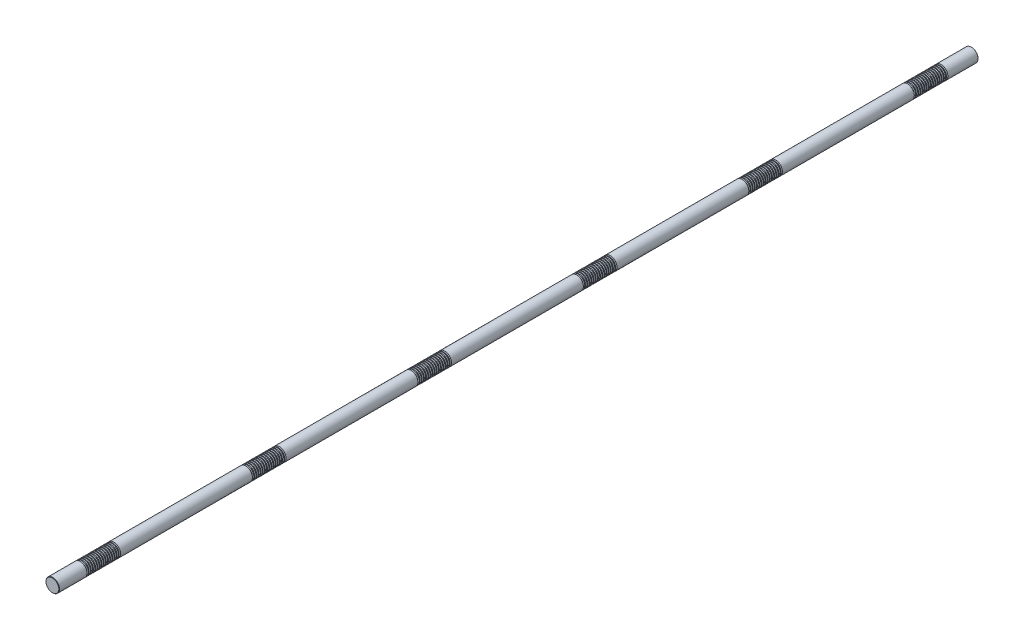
from build123d import *

# Parameters (mm, degrees)
SKETCH1_R           = 22
BOSS_EXTRUDE1_DEPTH = 1500
CHAMFER1_SIZE       = 1.1
LPATTERN1_COUNT     = 16
LPATTERN1_PITCH     = 7
LPATTERN2_COUNT     = 6
LPATTERN2_PITCH     = 540


with BuildPart() as part:
    # Sketch1 → Boss-Extrude1 (new, symmetric)
    with BuildSketch(Plane.XY):
        Circle(SKETCH1_R)
    extrude(amount=BOSS_EXTRUDE1_DEPTH, both=True)

    # Chamfer1
    chamfer1_edges = [part.edges().sort_by_distance(p)[0] for p in [
        (-22, 0, -1500),
        (-22, 0, 1500),
    ]]
    chamfer(chamfer1_edges, length=CHAMFER1_SIZE)

    # Sketch2 → Cut-Revolve1 (revolve, cut)
    with BuildSketch(Plane(origin=(0, 0, 0), x_dir=(0, 0, -1), z_dir=(1, 0, 0)), mode=Mode.PRIVATE) as cut_revolve1_sk:
        Polygon((1400.535898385, 22), (1395.964101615, 22), (1397.035898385, 18), (1399.464101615, 18), align=None)
    cut_revolve1 = revolve(cut_revolve1_sk.sketch.rotate(Axis((0, 0, 1500), (0, 0, -1)), 90), axis=Axis((0, 0, 1500), (0, 0, -1)), mode=Mode.SUBTRACT)

    # LPattern1: Cut-Revolve1 ×16
    with Locations(*[(0, 0, i * LPATTERN1_PITCH) for i in range(1, LPATTERN1_COUNT)]):
        add(cut_revolve1, mode=Mode.SUBTRACT)

    # LPattern2: Cut-Revolve1 ×6
    with Locations(*[(0, 0, i * LPATTERN2_PITCH) for i in range(1, LPATTERN2_COUNT)]):
        add(cut_revolve1, mode=Mode.SUBTRACT)

    # LPattern2 copy 1 sketch → LPattern2 copy 1 (revolve, cut)
    with BuildSketch(Plane(origin=(0, 0, 547), x_dir=(0, 0, -1), z_dir=(1, 0, 0))):
        Polygon((1400.535898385, 22), (1395.964101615, 22), (1397.035898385, 18), (1399.464101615, 18), align=None)
    revolve(axis=Axis((0, 0, 2047), (0, 0, -1)), mode=Mode.SUBTRACT)

    # LPattern2 copy 2 sketch → LPattern2 copy 2 (revolve, cut)
    with BuildSketch(Plane(origin=(0, 0, 1087), x_dir=(0, 0, -1), z_dir=(1, 0, 0))):
        Polygon((1400.535898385, 22), (1395.964101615, 22), (1397.035898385, 18), (1399.464101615, 18), align=None)
    revolve(axis=Axis((0, 0, 2587), (0, 0, -1)), mode=Mode.SUBTRACT)

    # LPattern2 copy 3 sketch → LPattern2 copy 3 (revolve, cut)
    with BuildSketch(Plane(origin=(0, 0, 1627), x_dir=(0, 0, -1), z_dir=(1, 0, 0))):
        Polygon((1400.535898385, 22), (1395.964101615, 22), (1397.035898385, 18), (1399.464101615, 18), align=None)
    revolve(axis=Axis((0, 0, 3127), (0, 0, -1)), mode=Mode.SUBTRACT)

    # LPattern2 copy 4 sketch → LPattern2 copy 4 (revolve, cut)
    with BuildSketch(Plane(origin=(0, 0, 2167), x_dir=(0, 0, -1), z_dir=(1, 0, 0))):
        Polygon((1400.535898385, 22), (1395.964101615, 22), (1397.035898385, 18), (1399.464101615, 18), align=None)
    revolve(axis=Axis((0, 0, 3667), (0, 0, -1)), mode=Mode.SUBTRACT)

    # LPattern2 copy 5 sketch → LPattern2 copy 5 (revolve, cut)
    with BuildSketch(Plane(origin=(0, 0, 2707), x_dir=(0, 0, -1), z_dir=(1, 0, 0))):
        Polygon((1400.535898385, 22), (1395.964101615, 22), (1397.035898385, 18), (1399.464101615, 18), align=None)
    revolve(axis=Axis((0, 0, 4207), (0, 0, -1)), mode=Mode.SUBTRACT)

    # LPattern2 copy 6 sketch → LPattern2 copy 6 (revolve, cut)
    with BuildSketch(Plane(origin=(0, 0, 554), x_dir=(0, 0, -1), z_dir=(1, 0, 0))):
        Polygon((1400.535898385, 22), (1395.964101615, 22), (1397.035898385, 18), (1399.464101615, 18), align=None)
    revolve(axis=Axis((0, 0, 2054), (0, 0, -1)), mode=Mode.SUBTRACT)

    # LPattern2 copy 7 sketch → LPattern2 copy 7 (revolve, cut)
    with BuildSketch(Plane(origin=(0, 0, 1094), x_dir=(0, 0, -1), z_dir=(1, 0, 0))):
        Polygon((1400.535898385, 22), (1395.964101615, 22), (1397.035898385, 18), (1399.464101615, 18), align=None)
    revolve(axis=Axis((0, 0, 2594), (0, 0, -1)), mode=Mode.SUBTRACT)

    # LPattern2 copy 8 sketch → LPattern2 copy 8 (revolve, cut)
    with BuildSketch(Plane(origin=(0, 0, 1634), x_dir=(0, 0, -1), z_dir=(1, 0, 0))):
        Polygon((1400.535898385, 22), (1395.964101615, 22), (1397.035898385, 18), (1399.464101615, 18), align=None)
    revolve(axis=Axis((0, 0, 3134), (0, 0, -1)), mode=Mode.SUBTRACT)

    # LPattern2 copy 9 sketch → LPattern2 copy 9 (revolve, cut)
    with BuildSketch(Plane(origin=(0, 0, 2174), x_dir=(0, 0, -1), z_dir=(1, 0, 0))):
        Polygon((1400.535898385, 22), (1395.964101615, 22), (1397.035898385, 18), (1399.464101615, 18), align=None)
    revolve(axis=Axis((0, 0, 3674), (0, 0, -1)), mode=Mode.SUBTRACT)

    # LPattern2 copy 10 sketch → LPattern2 copy 10 (revolve, cut)
    with BuildSketch(Plane(origin=(0, 0, 2714), x_dir=(0, 0, -1), z_dir=(1, 0, 0))):
        Polygon((1400.535898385, 22), (1395.964101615, 22), (1397.035898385, 18), (1399.464101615, 18), align=None)
    revolve(axis=Axis((0, 0, 4214), (0, 0, -1)), mode=Mode.SUBTRACT)

    # LPattern2 copy 11 sketch → LPattern2 copy 11 (revolve, cut)
    with BuildSketch(Plane(origin=(0, 0, 561), x_dir=(0, 0, -1), z_dir=(1, 0, 0))):
        Polygon((1400.535898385, 22), (1395.964101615, 22), (1397.035898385, 18), (1399.464101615, 18), align=None)
    revolve(axis=Axis((0, 0, 2061), (0, 0, -1)), mode=Mode.SUBTRACT)

    # LPattern2 copy 12 sketch → LPattern2 copy 12 (revolve, cut)
    with BuildSketch(Plane(origin=(0, 0, 1101), x_dir=(0, 0, -1), z_dir=(1, 0, 0))):
        Polygon((1400.535898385, 22), (1395.964101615, 22), (1397.035898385, 18), (1399.464101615, 18), align=None)
    revolve(axis=Axis((0, 0, 2601), (0, 0, -1)), mode=Mode.SUBTRACT)

    # LPattern2 copy 13 sketch → LPattern2 copy 13 (revolve, cut)
    with BuildSketch(Plane(origin=(0, 0, 1641), x_dir=(0, 0, -1), z_dir=(1, 0, 0))):
        Polygon((1400.535898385, 22), (1395.964101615, 22), (1397.035898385, 18), (1399.464101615, 18), align=None)
    revolve(axis=Axis((0, 0, 3141), (0, 0, -1)), mode=Mode.SUBTRACT)

    # LPattern2 copy 14 sketch → LPattern2 copy 14 (revolve, cut)
    with BuildSketch(Plane(origin=(0, 0, 2181), x_dir=(0, 0, -1), z_dir=(1, 0, 0))):
        Polygon((1400.535898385, 22), (1395.964101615, 22), (1397.035898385, 18), (1399.464101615, 18), align=None)
    revolve(axis=Axis((0, 0, 3681), (0, 0, -1)), mode=Mode.SUBTRACT)

    # LPattern2 copy 15 sketch → LPattern2 copy 15 (revolve, cut)
    with BuildSketch(Plane(origin=(0, 0, 2721), x_dir=(0, 0, -1), z_dir=(1, 0, 0))):
        Polygon((1400.535898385, 22), (1395.964101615, 22), (1397.035898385, 18), (1399.464101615, 18), align=None)
    revolve(axis=Axis((0, 0, 4221), (0, 0, -1)), mode=Mode.SUBTRACT)

    # LPattern2 copy 16 sketch → LPattern2 copy 16 (revolve, cut)
    with BuildSketch(Plane(origin=(0, 0, 568), x_dir=(0, 0, -1), z_dir=(1, 0, 0))):
        Polygon((1400.535898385, 22), (1395.964101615, 22), (1397.035898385, 18), (1399.464101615, 18), align=None)
    revolve(axis=Axis((0, 0, 2068), (0, 0, -1)), mode=Mode.SUBTRACT)

    # LPattern2 copy 17 sketch → LPattern2 copy 17 (revolve, cut)
    with BuildSketch(Plane(origin=(0, 0, 1108), x_dir=(0, 0, -1), z_dir=(1, 0, 0))):
        Polygon((1400.535898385, 22), (1395.964101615, 22), (1397.035898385, 18), (1399.464101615, 18), align=None)
    revolve(axis=Axis((0, 0, 2608), (0, 0, -1)), mode=Mode.SUBTRACT)

    # LPattern2 copy 18 sketch → LPattern2 copy 18 (revolve, cut)
    with BuildSketch(Plane(origin=(0, 0, 1648), x_dir=(0, 0, -1), z_dir=(1, 0, 0))):
        Polygon((1400.535898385, 22), (1395.964101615, 22), (1397.035898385, 18), (1399.464101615, 18), align=None)
    revolve(axis=Axis((0, 0, 3148), (0, 0, -1)), mode=Mode.SUBTRACT)

    # LPattern2 copy 19 sketch → LPattern2 copy 19 (revolve, cut)
    with BuildSketch(Plane(origin=(0, 0, 2188), x_dir=(0, 0, -1), z_dir=(1, 0, 0))):
        Polygon((1400.535898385, 22), (1395.964101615, 22), (1397.035898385, 18), (1399.464101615, 18), align=None)
    revolve(axis=Axis((0, 0, 3688), (0, 0, -1)), mode=Mode.SUBTRACT)

    # LPattern2 copy 20 sketch → LPattern2 copy 20 (revolve, cut)
    with BuildSketch(Plane(origin=(0, 0, 2728), x_dir=(0, 0, -1), z_dir=(1, 0, 0))):
        Polygon((1400.535898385, 22), (1395.964101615, 22), (1397.035898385, 18), (1399.464101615, 18), align=None)
    revolve(axis=Axis((0, 0, 4228), (0, 0, -1)), mode=Mode.SUBTRACT)

    # LPattern2 copy 21 sketch → LPattern2 copy 21 (revolve, cut)
    with BuildSketch(Plane(origin=(0, 0, 575), x_dir=(0, 0, -1), z_dir=(1, 0, 0))):
        Polygon((1400.535898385, 22), (1395.964101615, 22), (1397.035898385, 18), (1399.464101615, 18), align=None)
    revolve(axis=Axis((0, 0, 2075), (0, 0, -1)), mode=Mode.SUBTRACT)

    # LPattern2 copy 22 sketch → LPattern2 copy 22 (revolve, cut)
    with BuildSketch(Plane(origin=(0, 0, 1115), x_dir=(0, 0, -1), z_dir=(1, 0, 0))):
        Polygon((1400.535898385, 22), (1395.964101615, 22), (1397.035898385, 18), (1399.464101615, 18), align=None)
    revolve(axis=Axis((0, 0, 2615), (0, 0, -1)), mode=Mode.SUBTRACT)

    # LPattern2 copy 23 sketch → LPattern2 copy 23 (revolve, cut)
    with BuildSketch(Plane(origin=(0, 0, 1655), x_dir=(0, 0, -1), z_dir=(1, 0, 0))):
        Polygon((1400.535898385, 22), (1395.964101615, 22), (1397.035898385, 18), (1399.464101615, 18), align=None)
    revolve(axis=Axis((0, 0, 3155), (0, 0, -1)), mode=Mode.SUBTRACT)

    # LPattern2 copy 24 sketch → LPattern2 copy 24 (revolve, cut)
    with BuildSketch(Plane(origin=(0, 0, 2195), x_dir=(0, 0, -1), z_dir=(1, 0, 0))):
        Polygon((1400.535898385, 22), (1395.964101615, 22), (1397.035898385, 18), (1399.464101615, 18), align=None)
    revolve(axis=Axis((0, 0, 3695), (0, 0, -1)), mode=Mode.SUBTRACT)

    # LPattern2 copy 25 sketch → LPattern2 copy 25 (revolve, cut)
    with BuildSketch(Plane(origin=(0, 0, 2735), x_dir=(0, 0, -1), z_dir=(1, 0, 0))):
        Polygon((1400.535898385, 22), (1395.964101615, 22), (1397.035898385, 18), (1399.464101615, 18), align=None)
    revolve(axis=Axis((0, 0, 4235), (0, 0, -1)), mode=Mode.SUBTRACT)

    # LPattern2 copy 26 sketch → LPattern2 copy 26 (revolve, cut)
    with BuildSketch(Plane(origin=(0, 0, 582), x_dir=(0, 0, -1), z_dir=(1, 0, 0))):
        Polygon((1400.535898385, 22), (1395.964101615, 22), (1397.035898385, 18), (1399.464101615, 18), align=None)
    revolve(axis=Axis((0, 0, 2082), (0, 0, -1)), mode=Mode.SUBTRACT)

    # LPattern2 copy 27 sketch → LPattern2 copy 27 (revolve, cut)
    with BuildSketch(Plane(origin=(0, 0, 1122), x_dir=(0, 0, -1), z_dir=(1, 0, 0))):
        Polygon((1400.535898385, 22), (1395.964101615, 22), (1397.035898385, 18), (1399.464101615, 18), align=None)
    revolve(axis=Axis((0, 0, 2622), (0, 0, -1)), mode=Mode.SUBTRACT)

    # LPattern2 copy 28 sketch → LPattern2 copy 28 (revolve, cut)
    with BuildSketch(Plane(origin=(0, 0, 1662), x_dir=(0, 0, -1), z_dir=(1, 0, 0))):
        Polygon((1400.535898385, 22), (1395.964101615, 22), (1397.035898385, 18), (1399.464101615, 18), align=None)
    revolve(axis=Axis((0, 0, 3162), (0, 0, -1)), mode=Mode.SUBTRACT)

    # LPattern2 copy 29 sketch → LPattern2 copy 29 (revolve, cut)
    with BuildSketch(Plane(origin=(0, 0, 2202), x_dir=(0, 0, -1), z_dir=(1, 0, 0))):
        Polygon((1400.535898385, 22), (1395.964101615, 22), (1397.035898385, 18), (1399.464101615, 18), align=None)
    revolve(axis=Axis((0, 0, 3702), (0, 0, -1)), mode=Mode.SUBTRACT)

    # LPattern2 copy 30 sketch → LPattern2 copy 30 (revolve, cut)
    with BuildSketch(Plane(origin=(0, 0, 2742), x_dir=(0, 0, -1), z_dir=(1, 0, 0))):
        Polygon((1400.535898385, 22), (1395.964101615, 22), (1397.035898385, 18), (1399.464101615, 18), align=None)
    revolve(axis=Axis((0, 0, 4242), (0, 0, -1)), mode=Mode.SUBTRACT)

    # LPattern2 copy 31 sketch → LPattern2 copy 31 (revolve, cut)
    with BuildSketch(Plane(origin=(0, 0, 589), x_dir=(0, 0, -1), z_dir=(1, 0, 0))):
        Polygon((1400.535898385, 22), (1395.964101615, 22), (1397.035898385, 18), (1399.464101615, 18), align=None)
    revolve(axis=Axis((0, 0, 2089), (0, 0, -1)), mode=Mode.SUBTRACT)

    # LPattern2 copy 32 sketch → LPattern2 copy 32 (revolve, cut)
    with BuildSketch(Plane(origin=(0, 0, 1129), x_dir=(0, 0, -1), z_dir=(1, 0, 0))):
        Polygon((1400.535898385, 22), (1395.964101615, 22), (1397.035898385, 18), (1399.464101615, 18), align=None)
    revolve(axis=Axis((0, 0, 2629), (0, 0, -1)), mode=Mode.SUBTRACT)

    # LPattern2 copy 33 sketch → LPattern2 copy 33 (revolve, cut)
    with BuildSketch(Plane(origin=(0, 0, 1669), x_dir=(0, 0, -1), z_dir=(1, 0, 0))):
        Polygon((1400.535898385, 22), (1395.964101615, 22), (1397.035898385, 18), (1399.464101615, 18), align=None)
    revolve(axis=Axis((0, 0, 3169), (0, 0, -1)), mode=Mode.SUBTRACT)

    # LPattern2 copy 34 sketch → LPattern2 copy 34 (revolve, cut)
    with BuildSketch(Plane(origin=(0, 0, 2209), x_dir=(0, 0, -1), z_dir=(1, 0, 0))):
        Polygon((1400.535898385, 22), (1395.964101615, 22), (1397.035898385, 18), (1399.464101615, 18), align=None)
    revolve(axis=Axis((0, 0, 3709), (0, 0, -1)), mode=Mode.SUBTRACT)

    # LPattern2 copy 35 sketch → LPattern2 copy 35 (revolve, cut)
    with BuildSketch(Plane(origin=(0, 0, 2749), x_dir=(0, 0, -1), z_dir=(1, 0, 0))):
        Polygon((1400.535898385, 22), (1395.964101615, 22), (1397.035898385, 18), (1399.464101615, 18), align=None)
    revolve(axis=Axis((0, 0, 4249), (0, 0, -1)), mode=Mode.SUBTRACT)

    # LPattern2 copy 36 sketch → LPattern2 copy 36 (revolve, cut)
    with BuildSketch(Plane(origin=(0, 0, 596), x_dir=(0, 0, -1), z_dir=(1, 0, 0))):
        Polygon((1400.535898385, 22), (1395.964101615, 22), (1397.035898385, 18), (1399.464101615, 18), align=None)
    revolve(axis=Axis((0, 0, 2096), (0, 0, -1)), mode=Mode.SUBTRACT)

    # LPattern2 copy 37 sketch → LPattern2 copy 37 (revolve, cut)
    with BuildSketch(Plane(origin=(0, 0, 1136), x_dir=(0, 0, -1), z_dir=(1, 0, 0))):
        Polygon((1400.535898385, 22), (1395.964101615, 22), (1397.035898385, 18), (1399.464101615, 18), align=None)
    revolve(axis=Axis((0, 0, 2636), (0, 0, -1)), mode=Mode.SUBTRACT)

    # LPattern2 copy 38 sketch → LPattern2 copy 38 (revolve, cut)
    with BuildSketch(Plane(origin=(0, 0, 1676), x_dir=(0, 0, -1), z_dir=(1, 0, 0))):
        Polygon((1400.535898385, 22), (1395.964101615, 22), (1397.035898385, 18), (1399.464101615, 18), align=None)
    revolve(axis=Axis((0, 0, 3176), (0, 0, -1)), mode=Mode.SUBTRACT)

    # LPattern2 copy 39 sketch → LPattern2 copy 39 (revolve, cut)
    with BuildSketch(Plane(origin=(0, 0, 2216), x_dir=(0, 0, -1), z_dir=(1, 0, 0))):
        Polygon((1400.535898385, 22), (1395.964101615, 22), (1397.035898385, 18), (1399.464101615, 18), align=None)
    revolve(axis=Axis((0, 0, 3716), (0, 0, -1)), mode=Mode.SUBTRACT)

    # LPattern2 copy 40 sketch → LPattern2 copy 40 (revolve, cut)
    with BuildSketch(Plane(origin=(0, 0, 2756), x_dir=(0, 0, -1), z_dir=(1, 0, 0))):
        Polygon((1400.535898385, 22), (1395.964101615, 22), (1397.035898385, 18), (1399.464101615, 18), align=None)
    revolve(axis=Axis((0, 0, 4256), (0, 0, -1)), mode=Mode.SUBTRACT)

    # LPattern2 copy 41 sketch → LPattern2 copy 41 (revolve, cut)
    with BuildSketch(Plane(origin=(0, 0, 603), x_dir=(0, 0, -1), z_dir=(1, 0, 0))):
        Polygon((1400.535898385, 22), (1395.964101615, 22), (1397.035898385, 18), (1399.464101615, 18), align=None)
    revolve(axis=Axis((0, 0, 2103), (0, 0, -1)), mode=Mode.SUBTRACT)

    # LPattern2 copy 42 sketch → LPattern2 copy 42 (revolve, cut)
    with BuildSketch(Plane(origin=(0, 0, 1143), x_dir=(0, 0, -1), z_dir=(1, 0, 0))):
        Polygon((1400.535898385, 22), (1395.964101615, 22), (1397.035898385, 18), (1399.464101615, 18), align=None)
    revolve(axis=Axis((0, 0, 2643), (0, 0, -1)), mode=Mode.SUBTRACT)

    # LPattern2 copy 43 sketch → LPattern2 copy 43 (revolve, cut)
    with BuildSketch(Plane(origin=(0, 0, 1683), x_dir=(0, 0, -1), z_dir=(1, 0, 0))):
        Polygon((1400.535898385, 22), (1395.964101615, 22), (1397.035898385, 18), (1399.464101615, 18), align=None)
    revolve(axis=Axis((0, 0, 3183), (0, 0, -1)), mode=Mode.SUBTRACT)

    # LPattern2 copy 44 sketch → LPattern2 copy 44 (revolve, cut)
    with BuildSketch(Plane(origin=(0, 0, 2223), x_dir=(0, 0, -1), z_dir=(1, 0, 0))):
        Polygon((1400.535898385, 22), (1395.964101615, 22), (1397.035898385, 18), (1399.464101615, 18), align=None)
    revolve(axis=Axis((0, 0, 3723), (0, 0, -1)), mode=Mode.SUBTRACT)

    # LPattern2 copy 45 sketch → LPattern2 copy 45 (revolve, cut)
    with BuildSketch(Plane(origin=(0, 0, 2763), x_dir=(0, 0, -1), z_dir=(1, 0, 0))):
        Polygon((1400.535898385, 22), (1395.964101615, 22), (1397.035898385, 18), (1399.464101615, 18), align=None)
    revolve(axis=Axis((0, 0, 4263), (0, 0, -1)), mode=Mode.SUBTRACT)

    # LPattern2 copy 46 sketch → LPattern2 copy 46 (revolve, cut)
    with BuildSketch(Plane(origin=(0, 0, 610), x_dir=(0, 0, -1), z_dir=(1, 0, 0))):
        Polygon((1400.535898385, 22), (1395.964101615, 22), (1397.035898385, 18), (1399.464101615, 18), align=None)
    revolve(axis=Axis((0, 0, 2110), (0, 0, -1)), mode=Mode.SUBTRACT)

    # LPattern2 copy 47 sketch → LPattern2 copy 47 (revolve, cut)
    with BuildSketch(Plane(origin=(0, 0, 1150), x_dir=(0, 0, -1), z_dir=(1, 0, 0))):
        Polygon((1400.535898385, 22), (1395.964101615, 22), (1397.035898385, 18), (1399.464101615, 18), align=None)
    revolve(axis=Axis((0, 0, 2650), (0, 0, -1)), mode=Mode.SUBTRACT)

    # LPattern2 copy 48 sketch → LPattern2 copy 48 (revolve, cut)
    with BuildSketch(Plane(origin=(0, 0, 1690), x_dir=(0, 0, -1), z_dir=(1, 0, 0))):
        Polygon((1400.535898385, 22), (1395.964101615, 22), (1397.035898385, 18), (1399.464101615, 18), align=None)
    revolve(axis=Axis((0, 0, 3190), (0, 0, -1)), mode=Mode.SUBTRACT)

    # LPattern2 copy 49 sketch → LPattern2 copy 49 (revolve, cut)
    with BuildSketch(Plane(origin=(0, 0, 2230), x_dir=(0, 0, -1), z_dir=(1, 0, 0))):
        Polygon((1400.535898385, 22), (1395.964101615, 22), (1397.035898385, 18), (1399.464101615, 18), align=None)
    revolve(axis=Axis((0, 0, 3730), (0, 0, -1)), mode=Mode.SUBTRACT)

    # LPattern2 copy 50 sketch → LPattern2 copy 50 (revolve, cut)
    with BuildSketch(Plane(origin=(0, 0, 2770), x_dir=(0, 0, -1), z_dir=(1, 0, 0))):
        Polygon((1400.535898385, 22), (1395.964101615, 22), (1397.035898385, 18), (1399.464101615, 18), align=None)
    revolve(axis=Axis((0, 0, 4270), (0, 0, -1)), mode=Mode.SUBTRACT)

    # LPattern2 copy 51 sketch → LPattern2 copy 51 (revolve, cut)
    with BuildSketch(Plane(origin=(0, 0, 617), x_dir=(0, 0, -1), z_dir=(1, 0, 0))):
        Polygon((1400.535898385, 22), (1395.964101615, 22), (1397.035898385, 18), (1399.464101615, 18), align=None)
    revolve(axis=Axis((0, 0, 2117), (0, 0, -1)), mode=Mode.SUBTRACT)

    # LPattern2 copy 52 sketch → LPattern2 copy 52 (revolve, cut)
    with BuildSketch(Plane(origin=(0, 0, 1157), x_dir=(0, 0, -1), z_dir=(1, 0, 0))):
        Polygon((1400.535898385, 22), (1395.964101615, 22), (1397.035898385, 18), (1399.464101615, 18), align=None)
    revolve(axis=Axis((0, 0, 2657), (0, 0, -1)), mode=Mode.SUBTRACT)

    # LPattern2 copy 53 sketch → LPattern2 copy 53 (revolve, cut)
    with BuildSketch(Plane(origin=(0, 0, 1697), x_dir=(0, 0, -1), z_dir=(1, 0, 0))):
        Polygon((1400.535898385, 22), (1395.964101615, 22), (1397.035898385, 18), (1399.464101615, 18), align=None)
    revolve(axis=Axis((0, 0, 3197), (0, 0, -1)), mode=Mode.SUBTRACT)

    # LPattern2 copy 54 sketch → LPattern2 copy 54 (revolve, cut)
    with BuildSketch(Plane(origin=(0, 0, 2237), x_dir=(0, 0, -1), z_dir=(1, 0, 0))):
        Polygon((1400.535898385, 22), (1395.964101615, 22), (1397.035898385, 18), (1399.464101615, 18), align=None)
    revolve(axis=Axis((0, 0, 3737), (0, 0, -1)), mode=Mode.SUBTRACT)

    # LPattern2 copy 55 sketch → LPattern2 copy 55 (revolve, cut)
    with BuildSketch(Plane(origin=(0, 0, 2777), x_dir=(0, 0, -1), z_dir=(1, 0, 0))):
        Polygon((1400.535898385, 22), (1395.964101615, 22), (1397.035898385, 18), (1399.464101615, 18), align=None)
    revolve(axis=Axis((0, 0, 4277), (0, 0, -1)), mode=Mode.SUBTRACT)

    # LPattern2 copy 56 sketch → LPattern2 copy 56 (revolve, cut)
    with BuildSketch(Plane(origin=(0, 0, 624), x_dir=(0, 0, -1), z_dir=(1, 0, 0))):
        Polygon((1400.535898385, 22), (1395.964101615, 22), (1397.035898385, 18), (1399.464101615, 18), align=None)
    revolve(axis=Axis((0, 0, 2124), (0, 0, -1)), mode=Mode.SUBTRACT)

    # LPattern2 copy 57 sketch → LPattern2 copy 57 (revolve, cut)
    with BuildSketch(Plane(origin=(0, 0, 1164), x_dir=(0, 0, -1), z_dir=(1, 0, 0))):
        Polygon((1400.535898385, 22), (1395.964101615, 22), (1397.035898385, 18), (1399.464101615, 18), align=None)
    revolve(axis=Axis((0, 0, 2664), (0, 0, -1)), mode=Mode.SUBTRACT)

    # LPattern2 copy 58 sketch → LPattern2 copy 58 (revolve, cut)
    with BuildSketch(Plane(origin=(0, 0, 1704), x_dir=(0, 0, -1), z_dir=(1, 0, 0))):
        Polygon((1400.535898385, 22), (1395.964101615, 22), (1397.035898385, 18), (1399.464101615, 18), align=None)
    revolve(axis=Axis((0, 0, 3204), (0, 0, -1)), mode=Mode.SUBTRACT)

    # LPattern2 copy 59 sketch → LPattern2 copy 59 (revolve, cut)
    with BuildSketch(Plane(origin=(0, 0, 2244), x_dir=(0, 0, -1), z_dir=(1, 0, 0))):
        Polygon((1400.535898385, 22), (1395.964101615, 22), (1397.035898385, 18), (1399.464101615, 18), align=None)
    revolve(axis=Axis((0, 0, 3744), (0, 0, -1)), mode=Mode.SUBTRACT)

    # LPattern2 copy 60 sketch → LPattern2 copy 60 (revolve, cut)
    with BuildSketch(Plane(origin=(0, 0, 2784), x_dir=(0, 0, -1), z_dir=(1, 0, 0))):
        Polygon((1400.535898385, 22), (1395.964101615, 22), (1397.035898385, 18), (1399.464101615, 18), align=None)
    revolve(axis=Axis((0, 0, 4284), (0, 0, -1)), mode=Mode.SUBTRACT)

    # LPattern2 copy 61 sketch → LPattern2 copy 61 (revolve, cut)
    with BuildSketch(Plane(origin=(0, 0, 631), x_dir=(0, 0, -1), z_dir=(1, 0, 0))):
        Polygon((1400.535898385, 22), (1395.964101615, 22), (1397.035898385, 18), (1399.464101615, 18), align=None)
    revolve(axis=Axis((0, 0, 2131), (0, 0, -1)), mode=Mode.SUBTRACT)

    # LPattern2 copy 62 sketch → LPattern2 copy 62 (revolve, cut)
    with BuildSketch(Plane(origin=(0, 0, 1171), x_dir=(0, 0, -1), z_dir=(1, 0, 0))):
        Polygon((1400.535898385, 22), (1395.964101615, 22), (1397.035898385, 18), (1399.464101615, 18), align=None)
    revolve(axis=Axis((0, 0, 2671), (0, 0, -1)), mode=Mode.SUBTRACT)

    # LPattern2 copy 63 sketch → LPattern2 copy 63 (revolve, cut)
    with BuildSketch(Plane(origin=(0, 0, 1711), x_dir=(0, 0, -1), z_dir=(1, 0, 0))):
        Polygon((1400.535898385, 22), (1395.964101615, 22), (1397.035898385, 18), (1399.464101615, 18), align=None)
    revolve(axis=Axis((0, 0, 3211), (0, 0, -1)), mode=Mode.SUBTRACT)

    # LPattern2 copy 64 sketch → LPattern2 copy 64 (revolve, cut)
    with BuildSketch(Plane(origin=(0, 0, 2251), x_dir=(0, 0, -1), z_dir=(1, 0, 0))):
        Polygon((1400.535898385, 22), (1395.964101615, 22), (1397.035898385, 18), (1399.464101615, 18), align=None)
    revolve(axis=Axis((0, 0, 3751), (0, 0, -1)), mode=Mode.SUBTRACT)

    # LPattern2 copy 65 sketch → LPattern2 copy 65 (revolve, cut)
    with BuildSketch(Plane(origin=(0, 0, 2791), x_dir=(0, 0, -1), z_dir=(1, 0, 0))):
        Polygon((1400.535898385, 22), (1395.964101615, 22), (1397.035898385, 18), (1399.464101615, 18), align=None)
    revolve(axis=Axis((0, 0, 4291), (0, 0, -1)), mode=Mode.SUBTRACT)

    # LPattern2 copy 66 sketch → LPattern2 copy 66 (revolve, cut)
    with BuildSketch(Plane(origin=(0, 0, 638), x_dir=(0, 0, -1), z_dir=(1, 0, 0))):
        Polygon((1400.535898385, 22), (1395.964101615, 22), (1397.035898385, 18), (1399.464101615, 18), align=None)
    revolve(axis=Axis((0, 0, 2138), (0, 0, -1)), mode=Mode.SUBTRACT)

    # LPattern2 copy 67 sketch → LPattern2 copy 67 (revolve, cut)
    with BuildSketch(Plane(origin=(0, 0, 1178), x_dir=(0, 0, -1), z_dir=(1, 0, 0))):
        Polygon((1400.535898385, 22), (1395.964101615, 22), (1397.035898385, 18), (1399.464101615, 18), align=None)
    revolve(axis=Axis((0, 0, 2678), (0, 0, -1)), mode=Mode.SUBTRACT)

    # LPattern2 copy 68 sketch → LPattern2 copy 68 (revolve, cut)
    with BuildSketch(Plane(origin=(0, 0, 1718), x_dir=(0, 0, -1), z_dir=(1, 0, 0))):
        Polygon((1400.535898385, 22), (1395.964101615, 22), (1397.035898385, 18), (1399.464101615, 18), align=None)
    revolve(axis=Axis((0, 0, 3218), (0, 0, -1)), mode=Mode.SUBTRACT)

    # LPattern2 copy 69 sketch → LPattern2 copy 69 (revolve, cut)
    with BuildSketch(Plane(origin=(0, 0, 2258), x_dir=(0, 0, -1), z_dir=(1, 0, 0))):
        Polygon((1400.535898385, 22), (1395.964101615, 22), (1397.035898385, 18), (1399.464101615, 18), align=None)
    revolve(axis=Axis((0, 0, 3758), (0, 0, -1)), mode=Mode.SUBTRACT)

    # LPattern2 copy 70 sketch → LPattern2 copy 70 (revolve, cut)
    with BuildSketch(Plane(origin=(0, 0, 2798), x_dir=(0, 0, -1), z_dir=(1, 0, 0))):
        Polygon((1400.535898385, 22), (1395.964101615, 22), (1397.035898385, 18), (1399.464101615, 18), align=None)
    revolve(axis=Axis((0, 0, 4298), (0, 0, -1)), mode=Mode.SUBTRACT)

    # LPattern2 copy 71 sketch → LPattern2 copy 71 (revolve, cut)
    with BuildSketch(Plane(origin=(0, 0, 645), x_dir=(0, 0, -1), z_dir=(1, 0, 0))):
        Polygon((1400.535898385, 22), (1395.964101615, 22), (1397.035898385, 18), (1399.464101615, 18), align=None)
    revolve(axis=Axis((0, 0, 2145), (0, 0, -1)), mode=Mode.SUBTRACT)

    # LPattern2 copy 72 sketch → LPattern2 copy 72 (revolve, cut)
    with BuildSketch(Plane(origin=(0, 0, 1185), x_dir=(0, 0, -1), z_dir=(1, 0, 0))):
        Polygon((1400.535898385, 22), (1395.964101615, 22), (1397.035898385, 18), (1399.464101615, 18), align=None)
    revolve(axis=Axis((0, 0, 2685), (0, 0, -1)), mode=Mode.SUBTRACT)

    # LPattern2 copy 73 sketch → LPattern2 copy 73 (revolve, cut)
    with BuildSketch(Plane(origin=(0, 0, 1725), x_dir=(0, 0, -1), z_dir=(1, 0, 0))):
        Polygon((1400.535898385, 22), (1395.964101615, 22), (1397.035898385, 18), (1399.464101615, 18), align=None)
    revolve(axis=Axis((0, 0, 3225), (0, 0, -1)), mode=Mode.SUBTRACT)

    # LPattern2 copy 74 sketch → LPattern2 copy 74 (revolve, cut)
    with BuildSketch(Plane(origin=(0, 0, 2265), x_dir=(0, 0, -1), z_dir=(1, 0, 0))):
        Polygon((1400.535898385, 22), (1395.964101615, 22), (1397.035898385, 18), (1399.464101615, 18), align=None)
    revolve(axis=Axis((0, 0, 3765), (0, 0, -1)), mode=Mode.SUBTRACT)

    # LPattern2 copy 75 sketch → LPattern2 copy 75 (revolve, cut)
    with BuildSketch(Plane(origin=(0, 0, 2805), x_dir=(0, 0, -1), z_dir=(1, 0, 0))):
        Polygon((1400.535898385, 22), (1395.964101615, 22), (1397.035898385, 18), (1399.464101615, 18), align=None)
    revolve(axis=Axis((0, 0, 4305), (0, 0, -1)), mode=Mode.SUBTRACT)


solid = part.part
